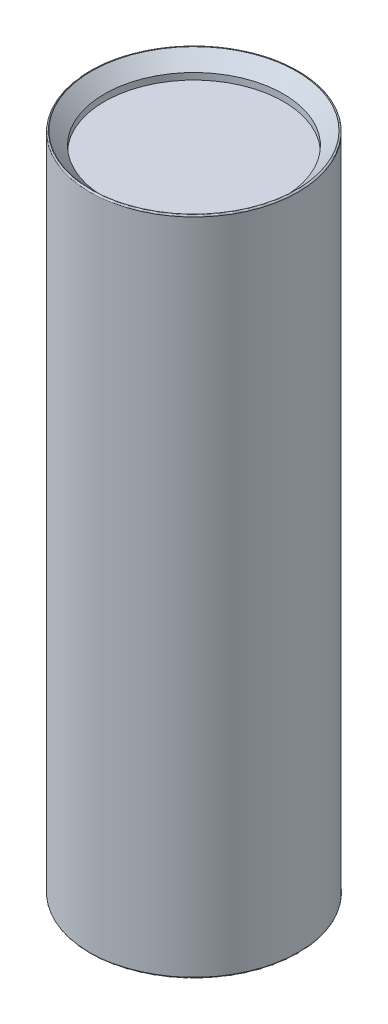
ISO-10303-21;
HEADER;
FILE_DESCRIPTION(('STEP AP214'),'2;1');
FILE_NAME('part.step','',(''),(''),'','','');
FILE_SCHEMA(('AUTOMOTIVE_DESIGN { 1 0 10303 214 1 1 1 1 }'));
ENDSEC;
DATA;
#1=APPLICATION_CONTEXT('core data for automotive mechanical design processes');
#2=APPLICATION_PROTOCOL_DEFINITION('international standard','automotive_design',2000,#1);
#3=PRODUCT_CONTEXT('',#1,'mechanical');
#4=PRODUCT('Part','Part','',(#3));
#5=PRODUCT_RELATED_PRODUCT_CATEGORY('part','',(#4));
#6=PRODUCT_DEFINITION_FORMATION('','',#4);
#7=PRODUCT_DEFINITION_CONTEXT('part definition',#1,'design');
#8=PRODUCT_DEFINITION('design','',#6,#7);
#9=PRODUCT_DEFINITION_SHAPE('','',#8);
#10=(LENGTH_UNIT() NAMED_UNIT(*) SI_UNIT(.MILLI.,.METRE.));
#11=(NAMED_UNIT(*) PLANE_ANGLE_UNIT() SI_UNIT($,.RADIAN.));
#12=(NAMED_UNIT(*) SI_UNIT($,.STERADIAN.) SOLID_ANGLE_UNIT());
#13=UNCERTAINTY_MEASURE_WITH_UNIT(LENGTH_MEASURE(1.E-05),#10,'distance_accuracy_value','');
#14=(GEOMETRIC_REPRESENTATION_CONTEXT(3) GLOBAL_UNCERTAINTY_ASSIGNED_CONTEXT((#13)) GLOBAL_UNIT_ASSIGNED_CONTEXT((#10,
#11,#12)) REPRESENTATION_CONTEXT('',''));
#15=CARTESIAN_POINT('',(0.,0.,0.));
#16=DIRECTION('',(0.,0.,1.));
#17=DIRECTION('',(1.,0.,0.));
#18=AXIS2_PLACEMENT_3D('',#15,#16,#17);
#19=CARTESIAN_POINT('',(0.,128.016,0.));
#20=DIRECTION('',(0.,-1.,0.));
#21=DIRECTION('',(0.,0.,-1.));
#22=AXIS2_PLACEMENT_3D('',#19,#20,#21);
#23=CYLINDRICAL_SURFACE('',#22,20.193);
#24=CARTESIAN_POINT('',(0.,127.762,0.));
#25=DIRECTION('',(0.,1.,0.));
#26=DIRECTION('',(0.,0.,1.));
#27=AXIS2_PLACEMENT_3D('',#24,#25,#26);
#28=CIRCLE('',#27,20.193);
#29=CARTESIAN_POINT('',(0.,127.762,20.193));
#30=VERTEX_POINT('',#29);
#31=EDGE_CURVE('E46',#30,#30,#28,.F.);
#32=ORIENTED_EDGE('',*,*,#31,.T.);
#33=EDGE_LOOP('',(#32));
#34=FACE_BOUND('',#33,.T.);
#35=CARTESIAN_POINT('',(0.,0.254000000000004,0.));
#36=DIRECTION('',(0.,1.,0.));
#37=DIRECTION('',(0.,0.,1.));
#38=AXIS2_PLACEMENT_3D('',#35,#36,#37);
#39=CIRCLE('',#38,20.193);
#40=CARTESIAN_POINT('',(0.,0.254000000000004,20.193));
#41=VERTEX_POINT('',#40);
#42=EDGE_CURVE('E77',#41,#41,#39,.T.);
#43=ORIENTED_EDGE('',*,*,#42,.T.);
#44=EDGE_LOOP('',(#43));
#45=FACE_BOUND('',#44,.T.);
#46=ADVANCED_FACE('F39',(#34,#45),#23,.T.);
#47=CARTESIAN_POINT('',(0.,128.016,0.));
#48=DIRECTION('',(0.,1.,0.));
#49=DIRECTION('',(0.,0.,1.));
#50=AXIS2_PLACEMENT_3D('',#47,#48,#49);
#51=PLANE('',#50);
#52=CARTESIAN_POINT('',(0.,128.016,0.));
#53=DIRECTION('',(0.,1.,0.));
#54=DIRECTION('',(0.,0.,1.));
#55=AXIS2_PLACEMENT_3D('',#52,#53,#54);
#56=CIRCLE('',#55,19.939);
#57=CARTESIAN_POINT('',(0.,128.016,19.939));
#58=VERTEX_POINT('',#57);
#59=EDGE_CURVE('E74',#58,#58,#56,.T.);
#60=ORIENTED_EDGE('',*,*,#59,.T.);
#61=EDGE_LOOP('',(#60));
#62=FACE_BOUND('',#61,.T.);
#63=CARTESIAN_POINT('',(0.,128.016,0.));
#64=DIRECTION('',(0.,1.,0.));
#65=DIRECTION('',(0.,0.,1.));
#66=AXIS2_PLACEMENT_3D('',#63,#64,#65);
#67=CIRCLE('',#66,19.868427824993);
#68=CARTESIAN_POINT('',(0.,128.016,19.868427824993));
#69=VERTEX_POINT('',#68);
#70=EDGE_CURVE('E71',#69,#69,#67,.F.);
#71=ORIENTED_EDGE('',*,*,#70,.T.);
#72=EDGE_LOOP('',(#71));
#73=FACE_BOUND('',#72,.T.);
#74=ADVANCED_FACE('F90',(#62,#73),#51,.T.);
#75=CARTESIAN_POINT('',(0.,0.,0.));
#76=DIRECTION('',(0.,1.,0.));
#77=DIRECTION('',(0.,0.,1.));
#78=AXIS2_PLACEMENT_3D('',#75,#76,#77);
#79=PLANE('',#78);
#80=CARTESIAN_POINT('',(0.,0.,0.));
#81=DIRECTION('',(0.,-1.,0.));
#82=DIRECTION('',(0.,0.,-1.));
#83=AXIS2_PLACEMENT_3D('',#80,#81,#82);
#84=CIRCLE('',#83,5.55625);
#85=CARTESIAN_POINT('',(0.,0.,-5.55625));
#86=VERTEX_POINT('',#85);
#87=EDGE_CURVE('E126',#86,#86,#84,.T.);
#88=ORIENTED_EDGE('',*,*,#87,.F.);
#89=EDGE_LOOP('',(#88));
#90=FACE_BOUND('',#89,.T.);
#91=CARTESIAN_POINT('',(0.,0.,0.));
#92=DIRECTION('',(0.,1.,0.));
#93=DIRECTION('',(0.,0.,1.));
#94=AXIS2_PLACEMENT_3D('',#91,#92,#93);
#95=CIRCLE('',#94,19.939);
#96=CARTESIAN_POINT('',(0.,0.,19.939));
#97=VERTEX_POINT('',#96);
#98=EDGE_CURVE('E11',#97,#97,#95,.F.);
#99=ORIENTED_EDGE('',*,*,#98,.T.);
#100=EDGE_LOOP('',(#99));
#101=FACE_BOUND('',#100,.T.);
#102=ADVANCED_FACE('F93',(#90,#101),#79,.F.);
#103=CARTESIAN_POINT('',(0.,124.206,0.));
#104=DIRECTION('',(0.,1.,0.));
#105=DIRECTION('',(0.,0.,1.));
#106=AXIS2_PLACEMENT_3D('',#103,#104,#105);
#107=CYLINDRICAL_SURFACE('',#106,17.328427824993);
#108=CARTESIAN_POINT('',(0.,125.476,0.));
#109=DIRECTION('',(0.,1.,0.));
#110=DIRECTION('',(0.,0.,1.));
#111=AXIS2_PLACEMENT_3D('',#108,#109,#110);
#112=CIRCLE('',#111,17.328427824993);
#113=CARTESIAN_POINT('',(0.,125.476,17.328427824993));
#114=VERTEX_POINT('',#113);
#115=EDGE_CURVE('E62',#114,#114,#112,.T.);
#116=CARTESIAN_POINT('',(0.,124.206,0.));
#117=DIRECTION('',(0.,1.,0.));
#118=DIRECTION('',(0.,0.,1.));
#119=AXIS2_PLACEMENT_3D('',#116,#117,#118);
#120=CIRCLE('',#119,17.328427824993);
#121=CARTESIAN_POINT('',(0.,124.206,17.328427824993));
#122=VERTEX_POINT('',#121);
#123=EDGE_CURVE('E58',#122,#122,#120,.T.);
#124=CARTESIAN_POINT('',(0.,125.476,17.328427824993));
#125=CARTESIAN_POINT('',(0.,125.462770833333,17.328427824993));
#126=CARTESIAN_POINT('',(0.,125.449541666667,17.328427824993));
#127=CARTESIAN_POINT('',(0.,125.423083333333,17.328427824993));
#128=CARTESIAN_POINT('',(0.,125.409854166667,17.328427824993));
#129=CARTESIAN_POINT('',(0.,125.383395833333,17.328427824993));
#130=CARTESIAN_POINT('',(0.,125.370166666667,17.328427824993));
#131=CARTESIAN_POINT('',(0.,125.343708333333,17.328427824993));
#132=CARTESIAN_POINT('',(0.,125.330479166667,17.328427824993));
#133=CARTESIAN_POINT('',(0.,125.304020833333,17.328427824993));
#134=CARTESIAN_POINT('',(0.,125.290791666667,17.328427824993));
#135=CARTESIAN_POINT('',(0.,125.264333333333,17.328427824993));
#136=CARTESIAN_POINT('',(0.,125.251104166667,17.328427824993));
#137=CARTESIAN_POINT('',(0.,125.224645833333,17.328427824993));
#138=CARTESIAN_POINT('',(0.,125.211416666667,17.328427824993));
#139=CARTESIAN_POINT('',(0.,125.184958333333,17.328427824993));
#140=CARTESIAN_POINT('',(0.,125.171729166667,17.328427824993));
#141=CARTESIAN_POINT('',(0.,125.145270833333,17.328427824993));
#142=CARTESIAN_POINT('',(0.,125.132041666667,17.328427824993));
#143=CARTESIAN_POINT('',(0.,125.105583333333,17.328427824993));
#144=CARTESIAN_POINT('',(0.,125.092354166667,17.328427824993));
#145=CARTESIAN_POINT('',(0.,125.065895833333,17.328427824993));
#146=CARTESIAN_POINT('',(0.,125.052666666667,17.328427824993));
#147=CARTESIAN_POINT('',(0.,125.026208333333,17.328427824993));
#148=CARTESIAN_POINT('',(0.,125.012979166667,17.328427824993));
#149=CARTESIAN_POINT('',(0.,124.986520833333,17.328427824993));
#150=CARTESIAN_POINT('',(0.,124.973291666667,17.328427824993));
#151=CARTESIAN_POINT('',(0.,124.946833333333,17.328427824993));
#152=CARTESIAN_POINT('',(0.,124.933604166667,17.328427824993));
#153=CARTESIAN_POINT('',(0.,124.907145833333,17.328427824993));
#154=CARTESIAN_POINT('',(0.,124.893916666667,17.328427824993));
#155=CARTESIAN_POINT('',(0.,124.867458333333,17.328427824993));
#156=CARTESIAN_POINT('',(0.,124.854229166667,17.328427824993));
#157=CARTESIAN_POINT('',(0.,124.827770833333,17.328427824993));
#158=CARTESIAN_POINT('',(0.,124.814541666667,17.328427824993));
#159=CARTESIAN_POINT('',(0.,124.788083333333,17.328427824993));
#160=CARTESIAN_POINT('',(0.,124.774854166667,17.328427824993));
#161=CARTESIAN_POINT('',(0.,124.748395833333,17.328427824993));
#162=CARTESIAN_POINT('',(0.,124.735166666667,17.328427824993));
#163=CARTESIAN_POINT('',(0.,124.708708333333,17.328427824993));
#164=CARTESIAN_POINT('',(0.,124.695479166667,17.328427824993));
#165=CARTESIAN_POINT('',(0.,124.669020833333,17.328427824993));
#166=CARTESIAN_POINT('',(0.,124.655791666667,17.328427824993));
#167=CARTESIAN_POINT('',(0.,124.629333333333,17.328427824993));
#168=CARTESIAN_POINT('',(0.,124.616104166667,17.328427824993));
#169=CARTESIAN_POINT('',(0.,124.589645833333,17.328427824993));
#170=CARTESIAN_POINT('',(0.,124.576416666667,17.328427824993));
#171=CARTESIAN_POINT('',(0.,124.549958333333,17.328427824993));
#172=CARTESIAN_POINT('',(0.,124.536729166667,17.328427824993));
#173=CARTESIAN_POINT('',(0.,124.510270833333,17.328427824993));
#174=CARTESIAN_POINT('',(0.,124.497041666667,17.328427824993));
#175=CARTESIAN_POINT('',(0.,124.470583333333,17.328427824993));
#176=CARTESIAN_POINT('',(0.,124.457354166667,17.328427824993));
#177=CARTESIAN_POINT('',(0.,124.430895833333,17.328427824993));
#178=CARTESIAN_POINT('',(0.,124.417666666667,17.328427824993));
#179=CARTESIAN_POINT('',(0.,124.391208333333,17.328427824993));
#180=CARTESIAN_POINT('',(0.,124.377979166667,17.328427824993));
#181=CARTESIAN_POINT('',(0.,124.351520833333,17.328427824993));
#182=CARTESIAN_POINT('',(0.,124.338291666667,17.328427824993));
#183=CARTESIAN_POINT('',(0.,124.311833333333,17.328427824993));
#184=CARTESIAN_POINT('',(0.,124.298604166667,17.328427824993));
#185=CARTESIAN_POINT('',(0.,124.272145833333,17.328427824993));
#186=CARTESIAN_POINT('',(0.,124.258916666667,17.328427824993));
#187=CARTESIAN_POINT('',(0.,124.232458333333,17.328427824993));
#188=CARTESIAN_POINT('',(0.,124.219229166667,17.328427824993));
#189=CARTESIAN_POINT('',(0.,124.206,17.328427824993));
#190=B_SPLINE_CURVE_WITH_KNOTS('',3,(#124,#125,#126,#127,#128,#129,#130,#131,#132,#133,#134,
#135,#136,#137,#138,#139,#140,#141,#142,#143,#144,#145,#146,#147,#148,#149,#150,#151,#152,#153,
#154,#155,#156,#157,#158,#159,#160,#161,#162,#163,#164,#165,#166,#167,#168,#169,#170,#171,#172,
#173,#174,#175,#176,#177,#178,#179,#180,#181,#182,#183,#184,#185,#186,#187,#188,#189),
.UNSPECIFIED.,.F.,.F.,(4,2,2,2,2,2,2,2,2,2,2,2,2,2,2,2,2,2,2,2,2,2,2,2,2,2,2,2,2,2,2,2,4),(0.,
0.0396875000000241,0.0793750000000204,0.119062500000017,0.158750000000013,0.198437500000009,
0.238125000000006,0.277812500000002,0.317499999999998,0.357187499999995,0.396874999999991,
0.436562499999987,0.47624999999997,0.515937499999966,0.555624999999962,0.595312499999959,
0.634999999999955,0.674687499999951,0.714374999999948,0.754062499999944,0.79374999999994,
0.833437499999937,0.873124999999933,0.912812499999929,0.952499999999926,0.992187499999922,
1.03187499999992,1.07156249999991,1.11124999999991,1.15093749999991,1.1906249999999,
1.2303124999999,1.2699999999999),.UNSPECIFIED.);
#191=EDGE_CURVE('BSEAM103',#114,#122,#190,.T.);
#192=ORIENTED_EDGE('',*,*,#115,.T.);
#193=ORIENTED_EDGE('',*,*,#123,.F.);
#194=ORIENTED_EDGE('',*,*,#191,.T.);
#195=ORIENTED_EDGE('',*,*,#191,.F.);
#196=EDGE_LOOP('',(#192,#194,#193,#195));
#197=FACE_BOUND('',#196,.T.);
#198=ADVANCED_FACE('F103',(#197),#107,.F.);
#199=CARTESIAN_POINT('',(0.,124.206,0.));
#200=DIRECTION('',(0.,1.,0.));
#201=DIRECTION('',(0.,0.,1.));
#202=AXIS2_PLACEMENT_3D('',#199,#200,#201);
#203=PLANE('',#202);
#204=ORIENTED_EDGE('',*,*,#123,.T.);
#205=EDGE_LOOP('',(#204));
#206=FACE_BOUND('',#205,.T.);
#207=ADVANCED_FACE('F99',(#206),#203,.T.);
#208=CARTESIAN_POINT('',(0.,125.476,0.));
#209=DIRECTION('',(0.,1.,0.));
#210=DIRECTION('',(0.,0.,1.));
#211=AXIS2_PLACEMENT_3D('',#208,#209,#210);
#212=CONICAL_SURFACE('',#211,17.328427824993,0.785398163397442);
#213=ORIENTED_EDGE('',*,*,#70,.F.);
#214=EDGE_LOOP('',(#213));
#215=FACE_BOUND('',#214,.T.);
#216=ORIENTED_EDGE('',*,*,#115,.F.);
#217=EDGE_LOOP('',(#216));
#218=FACE_BOUND('',#217,.T.);
#219=ADVANCED_FACE('F87',(#215,#218),#212,.F.);
#220=CARTESIAN_POINT('',(0.,127.762,0.));
#221=DIRECTION('',(0.,1.,0.));
#222=DIRECTION('',(0.,0.,1.));
#223=AXIS2_PLACEMENT_3D('',#220,#221,#222);
#224=TOROIDAL_SURFACE('',#223,19.939,0.254);
#225=ORIENTED_EDGE('',*,*,#31,.F.);
#226=EDGE_LOOP('',(#225));
#227=FACE_BOUND('',#226,.T.);
#228=ORIENTED_EDGE('',*,*,#59,.F.);
#229=EDGE_LOOP('',(#228));
#230=FACE_BOUND('',#229,.T.);
#231=ADVANCED_FACE('F84',(#227,#230),#224,.T.);
#232=CARTESIAN_POINT('',(0.,0.254000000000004,0.));
#233=DIRECTION('',(0.,1.,0.));
#234=DIRECTION('',(0.,0.,1.));
#235=AXIS2_PLACEMENT_3D('',#232,#233,#234);
#236=TOROIDAL_SURFACE('',#235,19.939,0.254);
#237=ORIENTED_EDGE('',*,*,#98,.F.);
#238=EDGE_LOOP('',(#237));
#239=FACE_BOUND('',#238,.T.);
#240=ORIENTED_EDGE('',*,*,#42,.F.);
#241=EDGE_LOOP('',(#240));
#242=FACE_BOUND('',#241,.T.);
#243=ADVANCED_FACE('F41',(#239,#242),#236,.T.);
#244=CARTESIAN_POINT('',(0.,26.035,0.));
#245=DIRECTION('',(0.,-1.,0.));
#246=DIRECTION('',(0.,0.,-1.));
#247=AXIS2_PLACEMENT_3D('',#244,#245,#246);
#248=CONICAL_SURFACE('',#247,4.96061999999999,1.02974425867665);
#249=CARTESIAN_POINT('',(0.,29.0156412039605,0.));
#250=VERTEX_POINT('',#249);
#251=VERTEX_LOOP('',#250);
#252=FACE_BOUND('',#251,.T.);
#253=CARTESIAN_POINT('',(0.,26.035,0.));
#254=DIRECTION('',(0.,-1.,0.));
#255=DIRECTION('',(0.,0.,-1.));
#256=AXIS2_PLACEMENT_3D('',#253,#254,#255);
#257=CIRCLE('',#256,4.96061999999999);
#258=CARTESIAN_POINT('',(0.,26.035,-4.96061999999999));
#259=VERTEX_POINT('',#258);
#260=EDGE_CURVE('E56',#259,#259,#257,.T.);
#261=ORIENTED_EDGE('',*,*,#260,.T.);
#262=EDGE_LOOP('',(#261));
#263=FACE_BOUND('',#262,.T.);
#264=ADVANCED_FACE('F49',(#252,#263),#248,.F.);
#265=CARTESIAN_POINT('',(0.,0.,0.));
#266=DIRECTION('',(0.,-1.,0.));
#267=DIRECTION('',(0.,0.,-1.));
#268=AXIS2_PLACEMENT_3D('',#265,#266,#267);
#269=CYLINDRICAL_SURFACE('',#268,4.96061999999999);
#270=ORIENTED_EDGE('',*,*,#260,.F.);
#271=EDGE_LOOP('',(#270));
#272=FACE_BOUND('',#271,.T.);
#273=CARTESIAN_POINT('',(0.,22.225,0.));
#274=DIRECTION('',(0.,-1.,0.));
#275=DIRECTION('',(0.,0.,-1.));
#276=AXIS2_PLACEMENT_3D('',#273,#274,#275);
#277=CIRCLE('',#276,4.96061999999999);
#278=CARTESIAN_POINT('',(0.,22.225,-4.96061999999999));
#279=VERTEX_POINT('',#278);
#280=EDGE_CURVE('E59',#279,#279,#277,.T.);
#281=ORIENTED_EDGE('',*,*,#280,.T.);
#282=EDGE_LOOP('',(#281));
#283=FACE_BOUND('',#282,.T.);
#284=ADVANCED_FACE('F52',(#272,#283),#269,.F.);
#285=CARTESIAN_POINT('',(4.96061999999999,22.225,0.));
#286=DIRECTION('',(0.,1.,0.));
#287=DIRECTION('',(0.,0.,1.));
#288=AXIS2_PLACEMENT_3D('',#285,#286,#287);
#289=PLANE('',#288);
#290=ORIENTED_EDGE('',*,*,#280,.F.);
#291=EDGE_LOOP('',(#290));
#292=FACE_BOUND('',#291,.T.);
#293=CARTESIAN_POINT('',(0.,22.225,0.));
#294=DIRECTION('',(0.,-1.,0.));
#295=DIRECTION('',(0.,0.,-1.));
#296=AXIS2_PLACEMENT_3D('',#293,#294,#295);
#297=CIRCLE('',#296,5.55625);
#298=CARTESIAN_POINT('',(0.,22.225,-5.55625));
#299=VERTEX_POINT('',#298);
#300=EDGE_CURVE('E65',#299,#299,#297,.T.);
#301=ORIENTED_EDGE('',*,*,#300,.T.);
#302=EDGE_LOOP('',(#301));
#303=FACE_BOUND('',#302,.T.);
#304=ADVANCED_FACE('F166',(#292,#303),#289,.F.);
#305=CARTESIAN_POINT('',(0.,0.,0.));
#306=DIRECTION('',(0.,-1.,0.));
#307=DIRECTION('',(0.,0.,-1.));
#308=AXIS2_PLACEMENT_3D('',#305,#306,#307);
#309=CYLINDRICAL_SURFACE('',#308,5.55625);
#310=ORIENTED_EDGE('',*,*,#300,.F.);
#311=EDGE_LOOP('',(#310));
#312=FACE_BOUND('',#311,.T.);
#313=ORIENTED_EDGE('',*,*,#87,.T.);
#314=EDGE_LOOP('',(#313));
#315=FACE_BOUND('',#314,.T.);
#316=ADVANCED_FACE('F173',(#312,#315),#309,.F.);
#317=CLOSED_SHELL('',(#46,#74,#102,#198,#207,#219,#231,#243,#264,#284,#304,#316));
#318=MANIFOLD_SOLID_BREP('B2',#317);
#319=ADVANCED_BREP_SHAPE_REPRESENTATION('',(#18,#318),#14);
#320=SHAPE_DEFINITION_REPRESENTATION(#9,#319);
ENDSEC;
END-ISO-10303-21;
